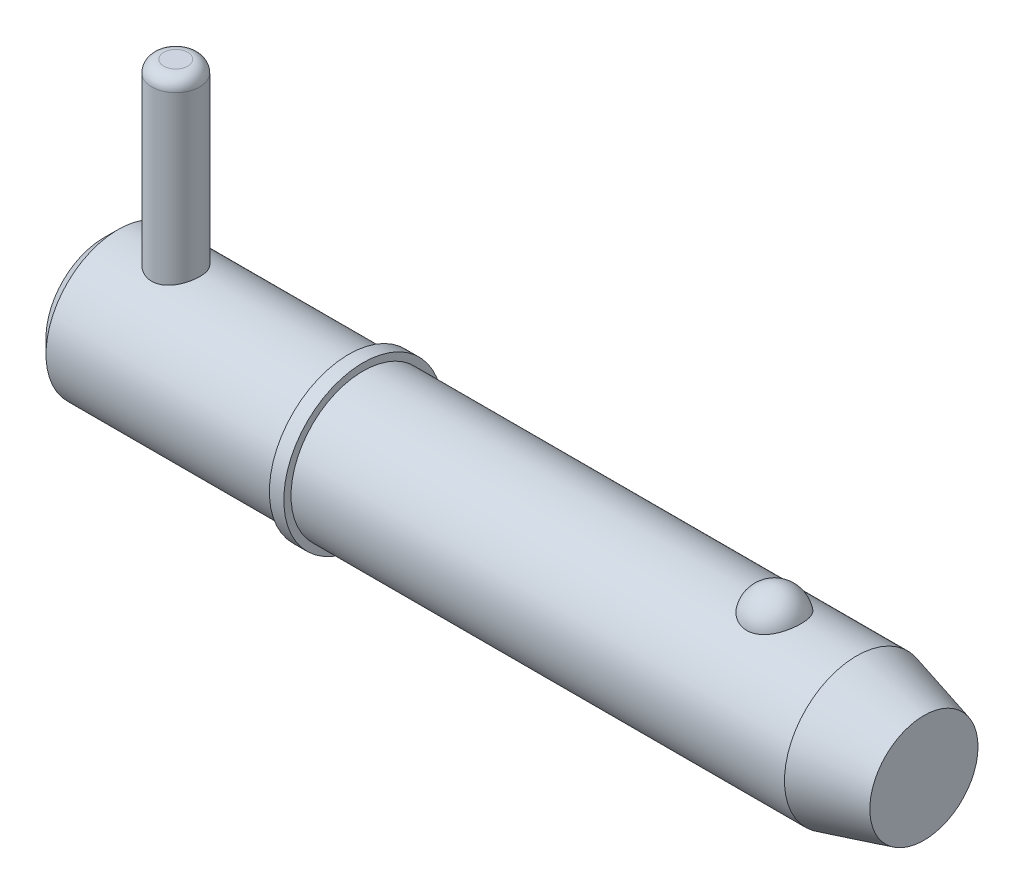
ISO-10303-21;
HEADER;
FILE_DESCRIPTION(('STEP AP214'),'2;1');
FILE_NAME('part.step','',(''),(''),'','','');
FILE_SCHEMA(('AUTOMOTIVE_DESIGN { 1 0 10303 214 1 1 1 1 }'));
ENDSEC;
DATA;
#1=APPLICATION_CONTEXT('core data for automotive mechanical design processes');
#2=APPLICATION_PROTOCOL_DEFINITION('international standard','automotive_design',2000,#1);
#3=PRODUCT_CONTEXT('',#1,'mechanical');
#4=PRODUCT('Part','Part','',(#3));
#5=PRODUCT_RELATED_PRODUCT_CATEGORY('part','',(#4));
#6=PRODUCT_DEFINITION_FORMATION('','',#4);
#7=PRODUCT_DEFINITION_CONTEXT('part definition',#1,'design');
#8=PRODUCT_DEFINITION('design','',#6,#7);
#9=PRODUCT_DEFINITION_SHAPE('','',#8);
#10=(LENGTH_UNIT() NAMED_UNIT(*) SI_UNIT(.MILLI.,.METRE.));
#11=(NAMED_UNIT(*) PLANE_ANGLE_UNIT() SI_UNIT($,.RADIAN.));
#12=(NAMED_UNIT(*) SI_UNIT($,.STERADIAN.) SOLID_ANGLE_UNIT());
#13=UNCERTAINTY_MEASURE_WITH_UNIT(LENGTH_MEASURE(1.E-05),#10,'distance_accuracy_value','');
#14=(GEOMETRIC_REPRESENTATION_CONTEXT(3) GLOBAL_UNCERTAINTY_ASSIGNED_CONTEXT((#13)) GLOBAL_UNIT_ASSIGNED_CONTEXT((#10,
#11,#12)) REPRESENTATION_CONTEXT('',''));
#15=CARTESIAN_POINT('',(0.,0.,0.));
#16=DIRECTION('',(0.,0.,1.));
#17=DIRECTION('',(1.,0.,0.));
#18=AXIS2_PLACEMENT_3D('',#15,#16,#17);
#19=CARTESIAN_POINT('',(7.14,24.605,0.));
#20=DIRECTION('',(0.,-1.,0.));
#21=DIRECTION('',(0.,0.,-1.));
#22=AXIS2_PLACEMENT_3D('',#19,#20,#21);
#23=CYLINDRICAL_SURFACE('',#22,2.38);
#24=CARTESIAN_POINT('',(7.14,-5.955,0.));
#25=DIRECTION('',(0.,1.,0.));
#26=DIRECTION('',(0.,0.,1.));
#27=AXIS2_PLACEMENT_3D('',#24,#25,#26);
#28=CIRCLE('',#27,2.38);
#29=CARTESIAN_POINT('',(7.14,-5.955,2.38));
#30=VERTEX_POINT('',#29);
#31=EDGE_CURVE('P0_E25',#30,#30,#28,.T.);
#32=ORIENTED_EDGE('',*,*,#31,.T.);
#33=EDGE_LOOP('',(#32));
#34=FACE_BOUND('',#33,.T.);
#35=CARTESIAN_POINT('',(7.14,23.415,0.));
#36=DIRECTION('',(0.,1.,0.));
#37=DIRECTION('',(0.,0.,1.));
#38=AXIS2_PLACEMENT_3D('',#35,#36,#37);
#39=CIRCLE('',#38,2.38);
#40=CARTESIAN_POINT('',(7.14,23.415,2.38));
#41=VERTEX_POINT('',#40);
#42=EDGE_CURVE('P0_E29',#41,#41,#39,.F.);
#43=ORIENTED_EDGE('',*,*,#42,.T.);
#44=EDGE_LOOP('',(#43));
#45=FACE_BOUND('',#44,.T.);
#46=ADVANCED_FACE('P0_F14',(#34,#45),#23,.T.);
#47=CARTESIAN_POINT('',(7.14,24.605,0.));
#48=DIRECTION('',(0.,1.,0.));
#49=DIRECTION('',(0.,0.,1.));
#50=AXIS2_PLACEMENT_3D('',#47,#48,#49);
#51=PLANE('',#50);
#52=CARTESIAN_POINT('',(7.14,24.605,0.));
#53=DIRECTION('',(0.,1.,0.));
#54=DIRECTION('',(0.,0.,1.));
#55=AXIS2_PLACEMENT_3D('',#52,#53,#54);
#56=CIRCLE('',#55,1.19);
#57=CARTESIAN_POINT('',(7.14,24.605,1.19));
#58=VERTEX_POINT('',#57);
#59=EDGE_CURVE('P0_E10',#58,#58,#56,.T.);
#60=ORIENTED_EDGE('',*,*,#59,.T.);
#61=EDGE_LOOP('',(#60));
#62=FACE_BOUND('',#61,.T.);
#63=ADVANCED_FACE('P0_F46',(#62),#51,.T.);
#64=CARTESIAN_POINT('',(7.14,-7.145,0.));
#65=DIRECTION('',(0.,1.,0.));
#66=DIRECTION('',(0.,0.,1.));
#67=AXIS2_PLACEMENT_3D('',#64,#65,#66);
#68=PLANE('',#67);
#69=CARTESIAN_POINT('',(7.14,-7.145,0.));
#70=DIRECTION('',(0.,1.,0.));
#71=DIRECTION('',(0.,0.,1.));
#72=AXIS2_PLACEMENT_3D('',#69,#70,#71);
#73=CIRCLE('',#72,1.19);
#74=CARTESIAN_POINT('',(7.14,-7.145,1.19));
#75=VERTEX_POINT('',#74);
#76=EDGE_CURVE('P0_E21',#75,#75,#73,.F.);
#77=ORIENTED_EDGE('',*,*,#76,.T.);
#78=EDGE_LOOP('',(#77));
#79=FACE_BOUND('',#78,.T.);
#80=ADVANCED_FACE('P0_F43',(#79),#68,.F.);
#81=CARTESIAN_POINT('',(7.14,-5.955,0.));
#82=DIRECTION('',(0.,1.,0.));
#83=DIRECTION('',(0.,0.,1.));
#84=AXIS2_PLACEMENT_3D('',#81,#82,#83);
#85=DEGENERATE_TOROIDAL_SURFACE('',#84,1.19,1.19,.T.);
#86=ORIENTED_EDGE('',*,*,#76,.F.);
#87=EDGE_LOOP('',(#86));
#88=FACE_BOUND('',#87,.T.);
#89=ORIENTED_EDGE('',*,*,#31,.F.);
#90=EDGE_LOOP('',(#89));
#91=FACE_BOUND('',#90,.T.);
#92=ADVANCED_FACE('P0_F38',(#88,#91),#85,.T.);
#93=CARTESIAN_POINT('',(7.14,23.415,0.));
#94=DIRECTION('',(0.,1.,0.));
#95=DIRECTION('',(0.,0.,1.));
#96=AXIS2_PLACEMENT_3D('',#93,#94,#95);
#97=DEGENERATE_TOROIDAL_SURFACE('',#96,1.19,1.19,.T.);
#98=ORIENTED_EDGE('',*,*,#42,.F.);
#99=EDGE_LOOP('',(#98));
#100=FACE_BOUND('',#99,.T.);
#101=ORIENTED_EDGE('',*,*,#59,.F.);
#102=EDGE_LOOP('',(#101));
#103=FACE_BOUND('',#102,.T.);
#104=ADVANCED_FACE('P0_F16',(#100,#103),#97,.T.);
#105=CLOSED_SHELL('',(#46,#63,#80,#92,#104));
#106=MANIFOLD_SOLID_BREP('P0_B1',#105);
#107=CARTESIAN_POINT('',(0.,0.,0.));
#108=DIRECTION('',(1.,0.,0.));
#109=DIRECTION('',(0.,0.,-1.));
#110=AXIS2_PLACEMENT_3D('',#107,#108,#109);
#111=CYLINDRICAL_SURFACE('',#110,7.145);
#112=CARTESIAN_POINT('',(74.5836242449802,0.,0.));
#113=DIRECTION('',(1.,0.,0.));
#114=DIRECTION('',(0.,0.,-1.));
#115=AXIS2_PLACEMENT_3D('',#112,#113,#114);
#116=CIRCLE('',#115,7.145);
#117=CARTESIAN_POINT('',(74.5836242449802,0.,-7.145));
#118=VERTEX_POINT('',#117);
#119=EDGE_CURVE('P1_E81',#118,#118,#116,.T.);
#120=ORIENTED_EDGE('',*,*,#119,.F.);
#121=EDGE_LOOP('',(#120));
#122=FACE_BOUND('',#121,.T.);
#123=CARTESIAN_POINT('',(25.7,0.,0.));
#124=DIRECTION('',(1.,0.,0.));
#125=DIRECTION('',(0.,0.,-1.));
#126=AXIS2_PLACEMENT_3D('',#123,#124,#125);
#127=CIRCLE('',#126,7.145);
#128=CARTESIAN_POINT('',(25.7,0.,-7.145));
#129=VERTEX_POINT('',#128);
#130=EDGE_CURVE('P1_E85',#129,#129,#127,.T.);
#131=ORIENTED_EDGE('',*,*,#130,.T.);
#132=EDGE_LOOP('',(#131));
#133=FACE_BOUND('',#132,.T.);
#134=CARTESIAN_POINT('',(66.4395037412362,6.60328629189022,2.72903557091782));
#135=CARTESIAN_POINT('',(66.2983158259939,6.60329644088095,2.72902496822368));
#136=CARTESIAN_POINT('',(66.1568832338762,6.60799490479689,2.71772840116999));
#137=CARTESIAN_POINT('',(65.8779557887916,6.62628236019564,2.67281935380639));
#138=CARTESIAN_POINT('',(65.7404726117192,6.63989534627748,2.63914664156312));
#139=CARTESIAN_POINT('',(65.4738894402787,6.67440775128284,2.55059642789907));
#140=CARTESIAN_POINT('',(65.3447683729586,6.69528793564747,2.49577486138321));
#141=CARTESIAN_POINT('',(65.0978694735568,6.74205585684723,2.36651799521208));
#142=CARTESIAN_POINT('',(64.9800865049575,6.76794130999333,2.29209163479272));
#143=CARTESIAN_POINT('',(64.7551671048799,6.82286177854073,2.12312937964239));
#144=CARTESIAN_POINT('',(64.6484405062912,6.85196655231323,2.02807107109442));
#145=CARTESIAN_POINT('',(64.4519181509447,6.90970232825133,1.82167822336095));
#146=CARTESIAN_POINT('',(64.3621276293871,6.93833318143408,1.71033867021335));
#147=CARTESIAN_POINT('',(64.1976670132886,6.9935167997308,1.46891951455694));
#148=CARTESIAN_POINT('',(64.123844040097,7.01992110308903,1.33822781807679));
#149=CARTESIAN_POINT('',(63.9980884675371,7.06643385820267,1.0656656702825));
#150=CARTESIAN_POINT('',(63.9461573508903,7.08654188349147,0.923794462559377));
#151=CARTESIAN_POINT('',(63.8647323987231,7.11862399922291,0.630993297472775));
#152=CARTESIAN_POINT('',(63.8355167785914,7.13049704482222,0.479974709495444));
#153=CARTESIAN_POINT('',(63.8011742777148,7.14449484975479,0.174782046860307));
#154=CARTESIAN_POINT('',(63.7960466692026,7.14661990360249,0.0206080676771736));
#155=CARTESIAN_POINT('',(63.809938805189,7.14092465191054,-0.285506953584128));
#156=CARTESIAN_POINT('',(63.8288101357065,7.1331654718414,-0.437455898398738));
#157=CARTESIAN_POINT('',(63.8900622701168,7.10859076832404,-0.73577860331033));
#158=CARTESIAN_POINT('',(63.9324435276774,7.0917750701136,-0.882152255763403));
#159=CARTESIAN_POINT('',(64.0399346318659,7.05076716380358,-1.16543149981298));
#160=CARTESIAN_POINT('',(64.1050759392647,7.02656475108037,-1.30232366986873));
#161=CARTESIAN_POINT('',(64.2567597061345,6.97329145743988,-1.56265907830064));
#162=CARTESIAN_POINT('',(64.343303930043,6.94422017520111,-1.68610120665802));
#163=CARTESIAN_POINT('',(64.5364654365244,6.88415108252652,-1.91671004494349));
#164=CARTESIAN_POINT('',(64.6431807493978,6.85314438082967,-2.02379244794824));
#165=CARTESIAN_POINT('',(64.8739740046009,6.79282069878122,-2.21787433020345));
#166=CARTESIAN_POINT('',(64.9980505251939,6.76350358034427,-2.30487545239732));
#167=CARTESIAN_POINT('',(65.2576784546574,6.7106058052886,-2.45458647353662));
#168=CARTESIAN_POINT('',(65.3929387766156,6.68691885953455,-2.5177624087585));
#169=CARTESIAN_POINT('',(65.6732778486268,6.64741247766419,-2.62030218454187));
#170=CARTESIAN_POINT('',(65.818352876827,6.63159007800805,-2.65967499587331));
#171=CARTESIAN_POINT('',(66.1063475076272,6.61038594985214,-2.71193301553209));
#172=CARTESIAN_POINT('',(66.2490080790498,6.60451880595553,-2.72605165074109));
#173=CARTESIAN_POINT('',(66.5348004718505,6.60240611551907,-2.73116688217));
#174=CARTESIAN_POINT('',(66.6779321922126,6.60615862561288,-2.72216814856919));
#175=CARTESIAN_POINT('',(66.9558486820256,6.6225609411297,-2.68200435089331));
#176=CARTESIAN_POINT('',(67.0907542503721,6.63492533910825,-2.65154998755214));
#177=CARTESIAN_POINT('',(67.35332009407,6.66687445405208,-2.57015684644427));
#178=CARTESIAN_POINT('',(67.4809797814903,6.68645975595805,-2.51921640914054));
#179=CARTESIAN_POINT('',(67.728577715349,6.73127274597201,-2.39693610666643));
#180=CARTESIAN_POINT('',(67.8482878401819,6.7566138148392,-2.32517694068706));
#181=CARTESIAN_POINT('',(68.0741592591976,6.8100600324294,-2.1636381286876));
#182=CARTESIAN_POINT('',(68.180317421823,6.83816581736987,-2.07385432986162));
#183=CARTESIAN_POINT('',(68.3818620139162,6.89580469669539,-1.87357235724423));
#184=CARTESIAN_POINT('',(68.476440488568,6.92533863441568,-1.76226074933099));
#185=CARTESIAN_POINT('',(68.6463329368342,6.98139526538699,-1.52511696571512));
#186=CARTESIAN_POINT('',(68.7216434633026,7.0079174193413,-1.39928219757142));
#187=CARTESIAN_POINT('',(68.8535955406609,7.05607625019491,-1.1321597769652));
#188=CARTESIAN_POINT('',(68.9095688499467,7.07753119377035,-0.990508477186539));
#189=CARTESIAN_POINT('',(68.9982965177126,7.11222355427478,-0.699154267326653));
#190=CARTESIAN_POINT('',(69.0310506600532,7.12546089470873,-0.549451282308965));
#191=CARTESIAN_POINT('',(69.0726899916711,7.1423758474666,-0.246120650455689));
#192=CARTESIAN_POINT('',(69.081558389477,7.14604673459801,-0.0924903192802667));
#193=CARTESIAN_POINT('',(69.0751940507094,7.14343510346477,0.214181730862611));
#194=CARTESIAN_POINT('',(69.0599618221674,7.13715279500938,0.367223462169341));
#195=CARTESIAN_POINT('',(69.0058451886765,7.11532948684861,0.667595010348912));
#196=CARTESIAN_POINT('',(68.9670776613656,7.09983424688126,0.814949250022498));
#197=CARTESIAN_POINT('',(68.8667700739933,7.06119140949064,1.10063221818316));
#198=CARTESIAN_POINT('',(68.8052284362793,7.03804328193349,1.23896032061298));
#199=CARTESIAN_POINT('',(68.6602071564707,6.98632429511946,1.5035230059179));
#200=CARTESIAN_POINT('',(68.5766067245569,6.95772382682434,1.62968561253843));
#201=CARTESIAN_POINT('',(68.3893804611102,6.89823072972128,1.865543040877));
#202=CARTESIAN_POINT('',(68.2857557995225,6.86733823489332,1.9752388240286));
#203=CARTESIAN_POINT('',(68.0610769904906,6.80676456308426,2.17482293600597));
#204=CARTESIAN_POINT('',(67.9400673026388,6.77708053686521,2.26476035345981));
#205=CARTESIAN_POINT('',(67.6833408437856,6.7223050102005,2.42252989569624));
#206=CARTESIAN_POINT('',(67.54761851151,6.69721525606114,2.49035362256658));
#207=CARTESIAN_POINT('',(67.2704022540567,6.65552591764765,2.59967646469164));
#208=CARTESIAN_POINT('',(67.1292810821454,6.63865794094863,2.64202017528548));
#209=CARTESIAN_POINT('',(66.8414448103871,6.61425039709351,2.70255841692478));
#210=CARTESIAN_POINT('',(66.6947480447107,6.60668259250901,2.720826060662));
#211=CARTESIAN_POINT('',(66.5116799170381,6.60358754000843,2.72830331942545));
#212=CARTESIAN_POINT('',(66.4755998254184,6.60328369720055,2.72903828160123));
#213=CARTESIAN_POINT('',(66.4395037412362,6.60328629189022,2.72903557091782));
#214=B_SPLINE_CURVE_WITH_KNOTS('',3,(#134,#135,#136,#137,#138,#139,#140,#141,#142,#143,#144,
#145,#146,#147,#148,#149,#150,#151,#152,#153,#154,#155,#156,#157,#158,#159,#160,#161,#162,#163,
#164,#165,#166,#167,#168,#169,#170,#171,#172,#173,#174,#175,#176,#177,#178,#179,#180,#181,#182,
#183,#184,#185,#186,#187,#188,#189,#190,#191,#192,#193,#194,#195,#196,#197,#198,#199,#200,#201,
#202,#203,#204,#205,#206,#207,#208,#209,#210,#211,#212,#213),.UNSPECIFIED.,.T.,.F.,(4,2,2,2,2,2,
2,2,2,2,2,2,2,2,2,2,2,2,2,2,2,2,2,2,2,2,2,2,2,2,2,2,2,2,2,2,2,2,2,4),(0.,0.423468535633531,
0.848081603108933,1.27157926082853,1.69488414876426,2.13051395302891,2.56627819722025,
3.0213670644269,3.47648674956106,3.93709649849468,4.39769233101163,4.85545355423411,
5.31322361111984,5.77162895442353,6.23007210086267,6.69080337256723,7.15149693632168,
7.60264329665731,8.05361952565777,8.48189729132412,8.91008854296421,9.32472524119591,
9.73939553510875,10.1630783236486,10.5868588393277,11.0319070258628,11.4770347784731,
11.9362874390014,12.3955443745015,12.855124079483,13.3146940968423,13.7720003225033,
14.2293382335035,14.6892343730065,15.1491036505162,15.6078171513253,16.0667046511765,
16.5093965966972,16.9507410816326,17.059004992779),.UNSPECIFIED.);
#215=CARTESIAN_POINT('',(66.4395037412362,6.60328629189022,2.72903557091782));
#216=VERTEX_POINT('',#215);
#217=EDGE_CURVE('P1_E35',#216,#216,#214,.T.);
#218=ORIENTED_EDGE('',*,*,#217,.T.);
#219=EDGE_LOOP('',(#218));
#220=FACE_BOUND('',#219,.T.);
#221=ADVANCED_FACE('P1_F13',(#122,#133,#220),#111,.T.);
#222=CARTESIAN_POINT('',(0.,0.,0.));
#223=DIRECTION('',(-1.,0.,0.));
#224=DIRECTION('',(0.,0.,1.));
#225=AXIS2_PLACEMENT_3D('',#222,#223,#224);
#226=PLANE('',#225);
#227=CARTESIAN_POINT('',(0.,0.,0.));
#228=DIRECTION('',(1.,0.,0.));
#229=DIRECTION('',(0.,0.,-1.));
#230=AXIS2_PLACEMENT_3D('',#227,#228,#229);
#231=CIRCLE('',#230,5.716);
#232=CARTESIAN_POINT('',(0.,0.,-5.716));
#233=VERTEX_POINT('',#232);
#234=EDGE_CURVE('P1_E9',#233,#233,#231,.T.);
#235=ORIENTED_EDGE('',*,*,#234,.F.);
#236=EDGE_LOOP('',(#235));
#237=FACE_BOUND('',#236,.T.);
#238=ADVANCED_FACE('P1_F15',(#237),#226,.T.);
#239=CARTESIAN_POINT('',(1.42899999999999,0.,0.));
#240=DIRECTION('',(1.,0.,0.));
#241=DIRECTION('',(0.,0.,-1.));
#242=AXIS2_PLACEMENT_3D('',#239,#240,#241);
#243=CONICAL_SURFACE('',#242,7.145,0.78539816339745);
#244=ORIENTED_EDGE('',*,*,#234,.T.);
#245=EDGE_LOOP('',(#244));
#246=FACE_BOUND('',#245,.T.);
#247=CARTESIAN_POINT('',(1.42899999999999,0.,0.));
#248=DIRECTION('',(1.,0.,0.));
#249=DIRECTION('',(0.,0.,-1.));
#250=AXIS2_PLACEMENT_3D('',#247,#248,#249);
#251=CIRCLE('',#250,7.145);
#252=CARTESIAN_POINT('',(1.42899999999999,0.,-7.145));
#253=VERTEX_POINT('',#252);
#254=EDGE_CURVE('P1_E26',#253,#253,#251,.T.);
#255=ORIENTED_EDGE('',*,*,#254,.F.);
#256=EDGE_LOOP('',(#255));
#257=FACE_BOUND('',#256,.T.);
#258=ADVANCED_FACE('P1_F77',(#246,#257),#243,.T.);
#259=CARTESIAN_POINT('',(0.,0.,0.));
#260=DIRECTION('',(1.,0.,0.));
#261=DIRECTION('',(0.,0.,-1.));
#262=AXIS2_PLACEMENT_3D('',#259,#260,#261);
#263=CYLINDRICAL_SURFACE('',#262,7.145);
#264=CARTESIAN_POINT('',(7.14,-6.73695962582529,2.38));
#265=CARTESIAN_POINT('',(7.01035997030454,-6.73695921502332,2.38000059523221));
#266=CARTESIAN_POINT('',(6.88072348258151,-6.74074253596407,2.36937183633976));
#267=CARTESIAN_POINT('',(6.62529075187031,-6.75538853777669,2.32728080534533));
#268=CARTESIAN_POINT('',(6.49949514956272,-6.76625239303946,2.29581507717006));
#269=CARTESIAN_POINT('',(6.2554858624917,-6.79369535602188,2.21327763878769));
#270=CARTESIAN_POINT('',(6.13725786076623,-6.81026326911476,2.16224430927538));
#271=CARTESIAN_POINT('',(5.91100349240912,-6.84723128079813,2.04215132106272));
#272=CARTESIAN_POINT('',(5.80297937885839,-6.86763222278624,1.97308769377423));
#273=CARTESIAN_POINT('',(5.59597854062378,-6.91086152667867,1.81600414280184));
#274=CARTESIAN_POINT('',(5.49745861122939,-6.93375032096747,1.72739874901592));
#275=CARTESIAN_POINT('',(5.31636508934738,-6.97886546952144,1.53499636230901));
#276=CARTESIAN_POINT('',(5.23379405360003,-7.00109171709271,1.43119693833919));
#277=CARTESIAN_POINT('',(5.08487013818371,-7.04307708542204,1.20801318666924));
#278=CARTESIAN_POINT('',(5.01899578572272,-7.06275685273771,1.08829330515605));
#279=CARTESIAN_POINT('',(4.90850130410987,-7.09671988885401,0.838703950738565));
#280=CARTESIAN_POINT('',(4.86387545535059,-7.11100460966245,0.70883722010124));
#281=CARTESIAN_POINT('',(4.79869354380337,-7.13213998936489,0.44742990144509));
#282=CARTESIAN_POINT('',(4.77735497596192,-7.13923172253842,0.316104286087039));
#283=CARTESIAN_POINT('',(4.75686536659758,-7.14603777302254,0.0515578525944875));
#284=CARTESIAN_POINT('',(4.75770861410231,-7.14575398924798,-0.0816624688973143));
#285=CARTESIAN_POINT('',(4.78106216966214,-7.13800438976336,-0.340678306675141));
#286=CARTESIAN_POINT('',(4.80272255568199,-7.13082030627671,-0.466560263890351));
#287=CARTESIAN_POINT('',(4.86569013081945,-7.11043095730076,-0.712788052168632));
#288=CARTESIAN_POINT('',(4.90699865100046,-7.09722528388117,-0.833133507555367));
#289=CARTESIAN_POINT('',(5.00858673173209,-7.06591754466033,-1.06673173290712));
#290=CARTESIAN_POINT('',(5.06910834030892,-7.0477534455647,-1.17987058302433));
#291=CARTESIAN_POINT('',(5.20720514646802,-7.00841977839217,-1.39463797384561));
#292=CARTESIAN_POINT('',(5.28478508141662,-6.987249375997,-1.49626330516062));
#293=CARTESIAN_POINT('',(5.4590800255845,-6.94296010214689,-1.69017445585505));
#294=CARTESIAN_POINT('',(5.55652324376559,-6.91979641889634,-1.78179645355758));
#295=CARTESIAN_POINT('',(5.76558873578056,-6.87497076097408,-1.94761348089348));
#296=CARTESIAN_POINT('',(5.87721318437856,-6.85330901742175,-2.02180583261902));
#297=CARTESIAN_POINT('',(6.11357367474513,-6.81369485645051,-2.15157488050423));
#298=CARTESIAN_POINT('',(6.23847358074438,-6.79579956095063,-2.20687188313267));
#299=CARTESIAN_POINT('',(6.49655785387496,-6.76640630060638,-2.29542443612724));
#300=CARTESIAN_POINT('',(6.62973872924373,-6.75490565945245,-2.32868920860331));
#301=CARTESIAN_POINT('',(6.89417536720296,-6.74020933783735,-2.37088225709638));
#302=CARTESIAN_POINT('',(7.02524746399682,-6.73666278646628,-2.38083959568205));
#303=CARTESIAN_POINT('',(7.28721035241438,-6.73729555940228,-2.37904974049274));
#304=CARTESIAN_POINT('',(7.41810117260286,-6.7414734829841,-2.36730648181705));
#305=CARTESIAN_POINT('',(7.67130717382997,-6.75673471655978,-2.32337336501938));
#306=CARTESIAN_POINT('',(7.79376251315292,-6.76757635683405,-2.29189834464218));
#307=CARTESIAN_POINT('',(8.03162917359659,-6.79467771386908,-2.21025275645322));
#308=CARTESIAN_POINT('',(8.14703924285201,-6.8109383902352,-2.16007887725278));
#309=CARTESIAN_POINT('',(8.37159169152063,-6.84768362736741,-2.04065289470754));
#310=CARTESIAN_POINT('',(8.48041962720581,-6.86828569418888,-1.97084668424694));
#311=CARTESIAN_POINT('',(8.68518919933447,-6.91116416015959,-1.8147657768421));
#312=CARTESIAN_POINT('',(8.78112702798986,-6.93344105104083,-1.72848623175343));
#313=CARTESIAN_POINT('',(8.96215574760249,-6.97845348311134,-1.53698616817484));
#314=CARTESIAN_POINT('',(9.04650427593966,-7.00115965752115,-1.43105491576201));
#315=CARTESIAN_POINT('',(9.19627592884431,-7.04341676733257,-1.20598377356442));
#316=CARTESIAN_POINT('',(9.26169972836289,-7.06296781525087,-1.08684435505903));
#317=CARTESIAN_POINT('',(9.37116617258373,-7.0966205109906,-0.83933303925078));
#318=CARTESIAN_POINT('',(9.41534821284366,-7.11075755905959,-0.711027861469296));
#319=CARTESIAN_POINT('',(9.48132660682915,-7.13214194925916,-0.448245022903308));
#320=CARTESIAN_POINT('',(9.50313102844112,-7.13939177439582,-0.313769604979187));
#321=CARTESIAN_POINT('',(9.5230098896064,-7.14599771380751,-0.049254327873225));
#322=CARTESIAN_POINT('',(9.52215013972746,-7.14570837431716,0.0806974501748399));
#323=CARTESIAN_POINT('',(9.49935359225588,-7.13814116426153,0.338518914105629));
#324=CARTESIAN_POINT('',(9.47741850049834,-7.13086385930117,0.466388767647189));
#325=CARTESIAN_POINT('',(9.4138005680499,-7.11026814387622,0.714400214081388));
#326=CARTESIAN_POINT('',(9.37243609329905,-7.09704726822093,0.834632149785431));
#327=CARTESIAN_POINT('',(9.27142829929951,-7.06592602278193,1.06649582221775));
#328=CARTESIAN_POINT('',(9.2117816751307,-7.04802480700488,1.1781259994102));
#329=CARTESIAN_POINT('',(9.07336776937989,-7.00856499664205,1.39411030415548));
#330=CARTESIAN_POINT('',(8.99397590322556,-6.98689577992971,1.49804368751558));
#331=CARTESIAN_POINT('',(8.81938810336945,-6.9426110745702,1.69146078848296));
#332=CARTESIAN_POINT('',(8.72418713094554,-6.91999528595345,1.78093988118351));
#333=CARTESIAN_POINT('',(8.51623540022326,-6.87531507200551,1.94646188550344));
#334=CARTESIAN_POINT('',(8.4029442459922,-6.85330672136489,2.02184316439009));
#335=CARTESIAN_POINT('',(8.16461714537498,-6.81342065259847,2.1524427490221));
#336=CARTESIAN_POINT('',(8.03958429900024,-6.7955418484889,2.20766635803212));
#337=CARTESIAN_POINT('',(7.78712566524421,-6.76686117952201,2.29403636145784));
#338=CARTESIAN_POINT('',(7.66006989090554,-6.75577342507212,2.32616709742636));
#339=CARTESIAN_POINT('',(7.40200728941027,-6.74082409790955,2.36914495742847));
#340=CARTESIAN_POINT('',(7.27100183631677,-6.73696004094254,2.37999939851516));
#341=CARTESIAN_POINT('',(7.14,-6.73695962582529,2.38));
#342=B_SPLINE_CURVE_WITH_KNOTS('',3,(#264,#265,#266,#267,#268,#269,#270,#271,#272,#273,#274,
#275,#276,#277,#278,#279,#280,#281,#282,#283,#284,#285,#286,#287,#288,#289,#290,#291,#292,#293,
#294,#295,#296,#297,#298,#299,#300,#301,#302,#303,#304,#305,#306,#307,#308,#309,#310,#311,#312,
#313,#314,#315,#316,#317,#318,#319,#320,#321,#322,#323,#324,#325,#326,#327,#328,#329,#330,#331,
#332,#333,#334,#335,#336,#337,#338,#339,#340,#341),.UNSPECIFIED.,.T.,.F.,(4,2,2,2,2,2,2,2,2,2,2,
2,2,2,2,2,2,2,2,2,2,2,2,2,2,2,2,2,2,2,2,2,2,2,2,2,2,2,4),(0.,0.388434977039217,
0.776934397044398,1.16467566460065,1.55250234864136,1.9540847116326,2.35573139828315,
2.76784120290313,3.17984001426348,3.57752248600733,3.97510257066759,4.35711073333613,
4.7391447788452,5.12619663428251,5.51335611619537,5.91871976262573,6.3241456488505,
6.73533623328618,7.14635459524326,7.53885245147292,7.93127914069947,8.31025106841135,
8.68929014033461,9.08033871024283,9.47150254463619,9.88145528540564,10.2913934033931,
10.6986033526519,11.1056664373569,11.4936225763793,11.8815473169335,12.2633262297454,
12.645174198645,13.0411187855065,13.437189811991,13.8487371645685,14.2601761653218,
14.6528265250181,15.0453418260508),.UNSPECIFIED.);
#343=CARTESIAN_POINT('',(7.14,-6.73695962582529,2.38));
#344=VERTEX_POINT('',#343);
#345=EDGE_CURVE('P1_E17',#344,#344,#342,.T.);
#346=ORIENTED_EDGE('',*,*,#345,.F.);
#347=EDGE_LOOP('',(#346));
#348=FACE_BOUND('',#347,.T.);
#349=CARTESIAN_POINT('',(7.14,6.73695962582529,2.38));
#350=CARTESIAN_POINT('',(7.26964002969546,6.73695921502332,2.38000059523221));
#351=CARTESIAN_POINT('',(7.39927651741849,6.74074253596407,2.36937183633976));
#352=CARTESIAN_POINT('',(7.65470924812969,6.75538853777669,2.32728080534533));
#353=CARTESIAN_POINT('',(7.78050485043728,6.76625239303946,2.29581507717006));
#354=CARTESIAN_POINT('',(8.02451413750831,6.79369535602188,2.21327763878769));
#355=CARTESIAN_POINT('',(8.14274213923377,6.81026326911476,2.16224430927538));
#356=CARTESIAN_POINT('',(8.36899650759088,6.84723128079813,2.04215132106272));
#357=CARTESIAN_POINT('',(8.47702062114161,6.86763222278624,1.97308769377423));
#358=CARTESIAN_POINT('',(8.68402145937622,6.91086152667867,1.81600414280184));
#359=CARTESIAN_POINT('',(8.78254138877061,6.93375032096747,1.72739874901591));
#360=CARTESIAN_POINT('',(8.96363491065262,6.97886546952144,1.53499636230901));
#361=CARTESIAN_POINT('',(9.04620594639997,7.00109171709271,1.43119693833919));
#362=CARTESIAN_POINT('',(9.19512986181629,7.04307708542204,1.20801318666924));
#363=CARTESIAN_POINT('',(9.26100421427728,7.06275685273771,1.08829330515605));
#364=CARTESIAN_POINT('',(9.37149869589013,7.09671988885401,0.838703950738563));
#365=CARTESIAN_POINT('',(9.41612454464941,7.11100460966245,0.708837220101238));
#366=CARTESIAN_POINT('',(9.48130645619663,7.13213998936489,0.447429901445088));
#367=CARTESIAN_POINT('',(9.50264502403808,7.13923172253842,0.316104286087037));
#368=CARTESIAN_POINT('',(9.52313463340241,7.14603777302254,0.0515578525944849));
#369=CARTESIAN_POINT('',(9.52229138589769,7.14575398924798,-0.0816624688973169));
#370=CARTESIAN_POINT('',(9.49893783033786,7.13800438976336,-0.340678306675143));
#371=CARTESIAN_POINT('',(9.47727744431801,7.13082030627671,-0.466560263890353));
#372=CARTESIAN_POINT('',(9.41430986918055,7.11043095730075,-0.712788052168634));
#373=CARTESIAN_POINT('',(9.37300134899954,7.09722528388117,-0.833133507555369));
#374=CARTESIAN_POINT('',(9.27141326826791,7.06591754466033,-1.06673173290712));
#375=CARTESIAN_POINT('',(9.21089165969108,7.0477534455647,-1.17987058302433));
#376=CARTESIAN_POINT('',(9.07279485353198,7.00841977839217,-1.39463797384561));
#377=CARTESIAN_POINT('',(8.99521491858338,6.987249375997,-1.49626330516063));
#378=CARTESIAN_POINT('',(8.82091997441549,6.94296010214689,-1.69017445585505));
#379=CARTESIAN_POINT('',(8.72347675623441,6.91979641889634,-1.78179645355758));
#380=CARTESIAN_POINT('',(8.51441126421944,6.87497076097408,-1.94761348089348));
#381=CARTESIAN_POINT('',(8.40278681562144,6.85330901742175,-2.02180583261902));
#382=CARTESIAN_POINT('',(8.16642632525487,6.81369485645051,-2.15157488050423));
#383=CARTESIAN_POINT('',(8.04152641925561,6.79579956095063,-2.20687188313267));
#384=CARTESIAN_POINT('',(7.78344214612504,6.76640630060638,-2.29542443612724));
#385=CARTESIAN_POINT('',(7.65026127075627,6.75490565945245,-2.32868920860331));
#386=CARTESIAN_POINT('',(7.38582463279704,6.74020933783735,-2.37088225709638));
#387=CARTESIAN_POINT('',(7.25475253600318,6.73666278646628,-2.38083959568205));
#388=CARTESIAN_POINT('',(6.99278964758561,6.73729555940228,-2.37904974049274));
#389=CARTESIAN_POINT('',(6.86189882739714,6.7414734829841,-2.36730648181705));
#390=CARTESIAN_POINT('',(6.60869282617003,6.75673471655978,-2.32337336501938));
#391=CARTESIAN_POINT('',(6.48623748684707,6.76757635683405,-2.29189834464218));
#392=CARTESIAN_POINT('',(6.2483708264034,6.79467771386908,-2.21025275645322));
#393=CARTESIAN_POINT('',(6.13296075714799,6.8109383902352,-2.16007887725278));
#394=CARTESIAN_POINT('',(5.90840830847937,6.84768362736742,-2.04065289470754));
#395=CARTESIAN_POINT('',(5.79958037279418,6.86828569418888,-1.97084668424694));
#396=CARTESIAN_POINT('',(5.59481080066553,6.91116416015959,-1.8147657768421));
#397=CARTESIAN_POINT('',(5.49887297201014,6.93344105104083,-1.72848623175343));
#398=CARTESIAN_POINT('',(5.31784425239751,6.97845348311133,-1.53698616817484));
#399=CARTESIAN_POINT('',(5.23349572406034,7.00115965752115,-1.43105491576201));
#400=CARTESIAN_POINT('',(5.08372407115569,7.04341676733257,-1.20598377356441));
#401=CARTESIAN_POINT('',(5.01830027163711,7.06296781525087,-1.08684435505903));
#402=CARTESIAN_POINT('',(4.90883382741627,7.0966205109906,-0.839333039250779));
#403=CARTESIAN_POINT('',(4.86465178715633,7.11075755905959,-0.711027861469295));
#404=CARTESIAN_POINT('',(4.79867339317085,7.13214194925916,-0.448245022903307));
#405=CARTESIAN_POINT('',(4.77686897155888,7.13939177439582,-0.313769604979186));
#406=CARTESIAN_POINT('',(4.7569901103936,7.14599771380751,-0.0492543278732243));
#407=CARTESIAN_POINT('',(4.75784986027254,7.14570837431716,0.0806974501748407));
#408=CARTESIAN_POINT('',(4.78064640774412,7.13814116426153,0.33851891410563));
#409=CARTESIAN_POINT('',(4.80258149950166,7.13086385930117,0.46638876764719));
#410=CARTESIAN_POINT('',(4.8661994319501,7.11026814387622,0.714400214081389));
#411=CARTESIAN_POINT('',(4.90756390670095,7.09704726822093,0.834632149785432));
#412=CARTESIAN_POINT('',(5.00857170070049,7.06592602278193,1.06649582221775));
#413=CARTESIAN_POINT('',(5.0682183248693,7.04802480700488,1.1781259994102));
#414=CARTESIAN_POINT('',(5.20663223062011,7.00856499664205,1.39411030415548));
#415=CARTESIAN_POINT('',(5.28602409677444,6.98689577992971,1.49804368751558));
#416=CARTESIAN_POINT('',(5.46061189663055,6.9426110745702,1.69146078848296));
#417=CARTESIAN_POINT('',(5.55581286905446,6.91999528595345,1.78093988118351));
#418=CARTESIAN_POINT('',(5.76376459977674,6.87531507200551,1.94646188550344));
#419=CARTESIAN_POINT('',(5.8770557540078,6.85330672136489,2.02184316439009));
#420=CARTESIAN_POINT('',(6.11538285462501,6.81342065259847,2.1524427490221));
#421=CARTESIAN_POINT('',(6.24041570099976,6.7955418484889,2.20766635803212));
#422=CARTESIAN_POINT('',(6.4928743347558,6.76686117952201,2.29403636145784));
#423=CARTESIAN_POINT('',(6.61993010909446,6.75577342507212,2.32616709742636));
#424=CARTESIAN_POINT('',(6.87799271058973,6.74082409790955,2.36914495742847));
#425=CARTESIAN_POINT('',(7.00899816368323,6.73696004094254,2.37999939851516));
#426=CARTESIAN_POINT('',(7.14,6.73695962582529,2.38));
#427=B_SPLINE_CURVE_WITH_KNOTS('',3,(#349,#350,#351,#352,#353,#354,#355,#356,#357,#358,#359,
#360,#361,#362,#363,#364,#365,#366,#367,#368,#369,#370,#371,#372,#373,#374,#375,#376,#377,#378,
#379,#380,#381,#382,#383,#384,#385,#386,#387,#388,#389,#390,#391,#392,#393,#394,#395,#396,#397,
#398,#399,#400,#401,#402,#403,#404,#405,#406,#407,#408,#409,#410,#411,#412,#413,#414,#415,#416,
#417,#418,#419,#420,#421,#422,#423,#424,#425,#426),.UNSPECIFIED.,.T.,.F.,(4,2,2,2,2,2,2,2,2,2,2,
2,2,2,2,2,2,2,2,2,2,2,2,2,2,2,2,2,2,2,2,2,2,2,2,2,2,2,4),(0.,0.388434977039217,
0.776934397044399,1.16467566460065,1.55250234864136,1.9540847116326,2.35573139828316,
2.76784120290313,3.17984001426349,3.57752248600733,3.97510257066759,4.35711073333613,
4.73914477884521,5.12619663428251,5.51335611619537,5.91871976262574,6.3241456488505,
6.73533623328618,7.14635459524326,7.53885245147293,7.93127914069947,8.31025106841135,
8.68929014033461,9.08033871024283,9.47150254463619,9.88145528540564,10.2913934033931,
10.6986033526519,11.1056664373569,11.4936225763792,11.8815473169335,12.2633262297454,
12.645174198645,13.0411187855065,13.437189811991,13.8487371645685,14.2601761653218,
14.6528265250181,15.0453418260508),.UNSPECIFIED.);
#428=CARTESIAN_POINT('',(7.14,6.73695962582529,2.38));
#429=VERTEX_POINT('',#428);
#430=EDGE_CURVE('P1_E43',#429,#429,#427,.T.);
#431=ORIENTED_EDGE('',*,*,#430,.F.);
#432=EDGE_LOOP('',(#431));
#433=FACE_BOUND('',#432,.T.);
#434=ORIENTED_EDGE('',*,*,#254,.T.);
#435=EDGE_LOOP('',(#434));
#436=FACE_BOUND('',#435,.T.);
#437=CARTESIAN_POINT('',(24.271,0.,0.));
#438=DIRECTION('',(1.,0.,0.));
#439=DIRECTION('',(0.,0.,-1.));
#440=AXIS2_PLACEMENT_3D('',#437,#438,#439);
#441=CIRCLE('',#440,7.145);
#442=CARTESIAN_POINT('',(24.271,0.,-7.145));
#443=VERTEX_POINT('',#442);
#444=EDGE_CURVE('P1_E31',#443,#443,#441,.T.);
#445=ORIENTED_EDGE('',*,*,#444,.F.);
#446=EDGE_LOOP('',(#445));
#447=FACE_BOUND('',#446,.T.);
#448=ADVANCED_FACE('P1_F103',(#348,#433,#436,#447),#263,.T.);
#449=CARTESIAN_POINT('',(24.271,7.145,0.));
#450=DIRECTION('',(-1.,0.,0.));
#451=DIRECTION('',(0.,0.,1.));
#452=AXIS2_PLACEMENT_3D('',#449,#450,#451);
#453=PLANE('',#452);
#454=ORIENTED_EDGE('',*,*,#444,.T.);
#455=EDGE_LOOP('',(#454));
#456=FACE_BOUND('',#455,.T.);
#457=CARTESIAN_POINT('',(24.271,0.,0.));
#458=DIRECTION('',(1.,0.,0.));
#459=DIRECTION('',(0.,0.,-1.));
#460=AXIS2_PLACEMENT_3D('',#457,#458,#459);
#461=CIRCLE('',#460,7.8595);
#462=CARTESIAN_POINT('',(24.271,0.,-7.8595));
#463=VERTEX_POINT('',#462);
#464=EDGE_CURVE('P1_E91',#463,#463,#461,.T.);
#465=ORIENTED_EDGE('',*,*,#464,.F.);
#466=EDGE_LOOP('',(#465));
#467=FACE_BOUND('',#466,.T.);
#468=ADVANCED_FACE('P1_F100',(#456,#467),#453,.T.);
#469=CARTESIAN_POINT('',(0.,0.,0.));
#470=DIRECTION('',(1.,0.,0.));
#471=DIRECTION('',(0.,0.,-1.));
#472=AXIS2_PLACEMENT_3D('',#469,#470,#471);
#473=CYLINDRICAL_SURFACE('',#472,7.8595);
#474=ORIENTED_EDGE('',*,*,#464,.T.);
#475=EDGE_LOOP('',(#474));
#476=FACE_BOUND('',#475,.T.);
#477=CARTESIAN_POINT('',(25.7,0.,0.));
#478=DIRECTION('',(1.,0.,0.));
#479=DIRECTION('',(0.,0.,-1.));
#480=AXIS2_PLACEMENT_3D('',#477,#478,#479);
#481=CIRCLE('',#480,7.8595);
#482=CARTESIAN_POINT('',(25.7,0.,-7.8595));
#483=VERTEX_POINT('',#482);
#484=EDGE_CURVE('P1_E88',#483,#483,#481,.T.);
#485=ORIENTED_EDGE('',*,*,#484,.F.);
#486=EDGE_LOOP('',(#485));
#487=FACE_BOUND('',#486,.T.);
#488=ADVANCED_FACE('P1_F68',(#476,#487),#473,.T.);
#489=CARTESIAN_POINT('',(25.7,7.8595,0.));
#490=DIRECTION('',(1.,0.,0.));
#491=DIRECTION('',(0.,0.,-1.));
#492=AXIS2_PLACEMENT_3D('',#489,#490,#491);
#493=PLANE('',#492);
#494=ORIENTED_EDGE('',*,*,#484,.T.);
#495=EDGE_LOOP('',(#494));
#496=FACE_BOUND('',#495,.T.);
#497=ORIENTED_EDGE('',*,*,#130,.F.);
#498=EDGE_LOOP('',(#497));
#499=FACE_BOUND('',#498,.T.);
#500=ADVANCED_FACE('P1_F62',(#496,#499),#493,.T.);
#501=CARTESIAN_POINT('',(81.25,0.,0.));
#502=DIRECTION('',(-1.,0.,0.));
#503=DIRECTION('',(0.,0.,1.));
#504=AXIS2_PLACEMENT_3D('',#501,#502,#503);
#505=CONICAL_SURFACE('',#504,5.35875000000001,0.261799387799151);
#506=ORIENTED_EDGE('',*,*,#119,.T.);
#507=EDGE_LOOP('',(#506));
#508=FACE_BOUND('',#507,.T.);
#509=CARTESIAN_POINT('',(81.25,0.,0.));
#510=DIRECTION('',(1.,0.,0.));
#511=DIRECTION('',(0.,0.,-1.));
#512=AXIS2_PLACEMENT_3D('',#509,#510,#511);
#513=CIRCLE('',#512,5.35875000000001);
#514=CARTESIAN_POINT('',(81.25,0.,-5.35875000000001));
#515=VERTEX_POINT('',#514);
#516=EDGE_CURVE('P1_E42',#515,#515,#513,.T.);
#517=ORIENTED_EDGE('',*,*,#516,.F.);
#518=EDGE_LOOP('',(#517));
#519=FACE_BOUND('',#518,.T.);
#520=ADVANCED_FACE('P1_F59',(#508,#519),#505,.T.);
#521=CARTESIAN_POINT('',(81.25,5.35875000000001,0.));
#522=DIRECTION('',(1.,0.,0.));
#523=DIRECTION('',(0.,0.,-1.));
#524=AXIS2_PLACEMENT_3D('',#521,#522,#523);
#525=PLANE('',#524);
#526=ORIENTED_EDGE('',*,*,#516,.T.);
#527=EDGE_LOOP('',(#526));
#528=FACE_BOUND('',#527,.T.);
#529=ADVANCED_FACE('P1_F55',(#528),#525,.T.);
#530=CARTESIAN_POINT('',(66.4395037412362,6.4305,0.));
#531=DIRECTION('',(-1.,0.,0.));
#532=DIRECTION('',(0.,-1.,0.));
#533=AXIS2_PLACEMENT_3D('',#530,#531,#532);
#534=SPHERICAL_SURFACE('',#533,2.73449999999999);
#535=ORIENTED_EDGE('',*,*,#217,.F.);
#536=EDGE_LOOP('',(#535));
#537=FACE_BOUND('',#536,.T.);
#538=ADVANCED_FACE('P1_F50',(#537),#534,.T.);
#539=CARTESIAN_POINT('',(7.14,-7.8595,0.));
#540=DIRECTION('',(0.,1.,0.));
#541=DIRECTION('',(0.,0.,1.));
#542=AXIS2_PLACEMENT_3D('',#539,#540,#541);
#543=CYLINDRICAL_SURFACE('',#542,2.38);
#544=ORIENTED_EDGE('',*,*,#345,.T.);
#545=EDGE_LOOP('',(#544));
#546=FACE_BOUND('',#545,.T.);
#547=ORIENTED_EDGE('',*,*,#430,.T.);
#548=EDGE_LOOP('',(#547));
#549=FACE_BOUND('',#548,.T.);
#550=ADVANCED_FACE('P1_F54',(#546,#549),#543,.F.);
#551=CLOSED_SHELL('',(#221,#238,#258,#448,#468,#488,#500,#520,#529,#538,#550));
#552=MANIFOLD_SOLID_BREP('P1_B1',#551);
#553=ADVANCED_BREP_SHAPE_REPRESENTATION('',(#18,#106,#552),#14);
#554=SHAPE_DEFINITION_REPRESENTATION(#9,#553);
ENDSEC;
END-ISO-10303-21;
